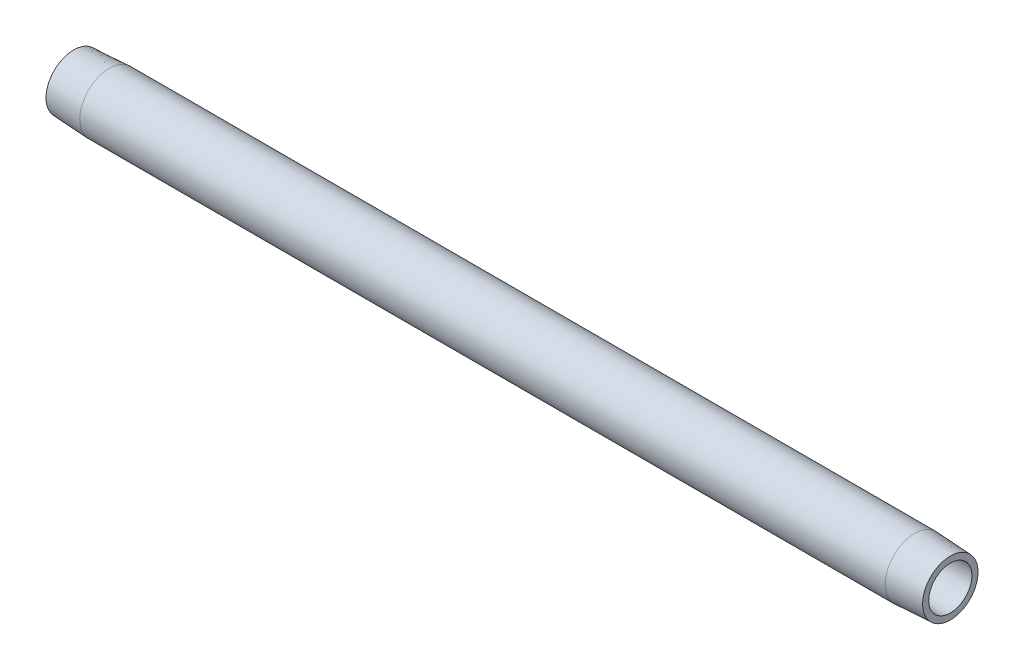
from build123d import *


with BuildPart() as part:
    # Sketch1 → Revolve1 (revolve)
    with BuildSketch(Plane.XY, mode=Mode.PRIVATE) as revolve1_sk:
        Polygon((254, 6.2611), (0, 6.2611), (0, 8.032050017), (10.3124, 8.5725), (243.6876, 8.5725), (254, 8.032050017), align=None)
    revolve(revolve1_sk.sketch.rotate(Axis((0, 0, 0), (1, 0, 0)), 90), axis=Axis((0, 0, 0), (1, 0, 0)))


solid = part.part
